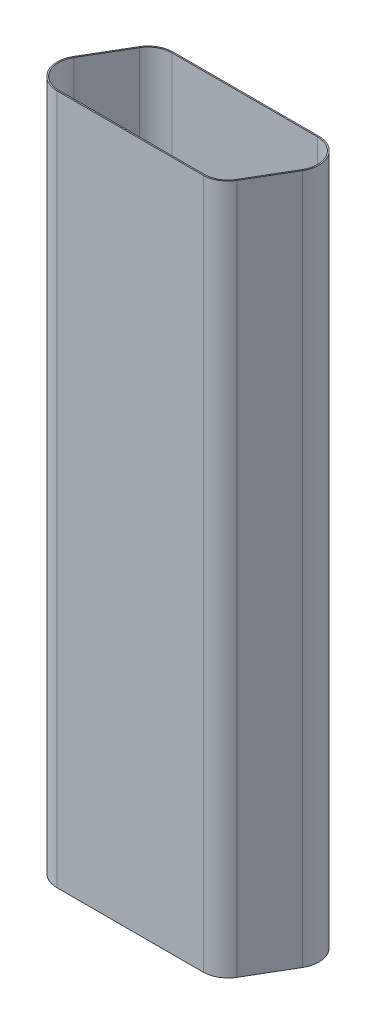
from build123d import *

# Parameters (mm, degrees)
BOSS_EXTRUDE1_DEPTH = 263


with BuildPart() as part:
    # Sketch1 → Boss-Extrude1 (new body)
    with BuildSketch(Plane(origin=(0, 0, 0), x_dir=(-1, 0, 0), z_dir=(0, 1, 0))):
        with BuildLine():
            Line((-73.032084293, -10.862527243), (-63.782084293, 4.869605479))
            ThreePointArc((-63.782084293, 4.869605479), (-60.349947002, 8.293611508), (-55.682893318, 9.605859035))
            Line((-55.682893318, 9.605859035), (0.154964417, 9.60635018))
            ThreePointArc((0.154964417, 9.60635018), (8.377605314, 4.703371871), (8.282084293, -4.869605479))
            Line((8.282084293, -4.869605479), (-0.967915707, -20.601738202))
            ThreePointArc((-0.967915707, -20.601738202), (-4.479216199, -24.071533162), (-9.25, -25.339732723))
            Line((-9.25, -25.339732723), (-64.75, -25.339732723))
            ThreePointArc((-64.75, -25.339732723), (-73.089400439, -20.502916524), (-73.032084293, -10.862527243))
        make_face()
        with BuildLine():
            Line((-64.75, -24.857132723), (-9.25, -24.857132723))
            ThreePointArc((-9.25, -24.857132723), (-4.71885776, -23.652636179), (-1.383933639, -20.357132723))
            Line((-1.383933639, -20.357132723), (7.866066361, -4.625))
            ThreePointArc((7.866066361, -4.625), (7.920503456, 4.53114224), (0, 9.125))
            Line((0, 9.125), (-55.5, 9.125))
            ThreePointArc((-55.5, 9.125), (-60.03114224, 7.920503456), (-63.366066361, 4.625))
            Line((-63.366066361, 4.625), (-72.616066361, -11.107132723))
            ThreePointArc((-72.616066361, -11.107132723), (-72.670503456, -20.263274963), (-64.75, -24.857132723))
        make_face(mode=Mode.SUBTRACT)
    extrude(amount=BOSS_EXTRUDE1_DEPTH)


solid = part.part
